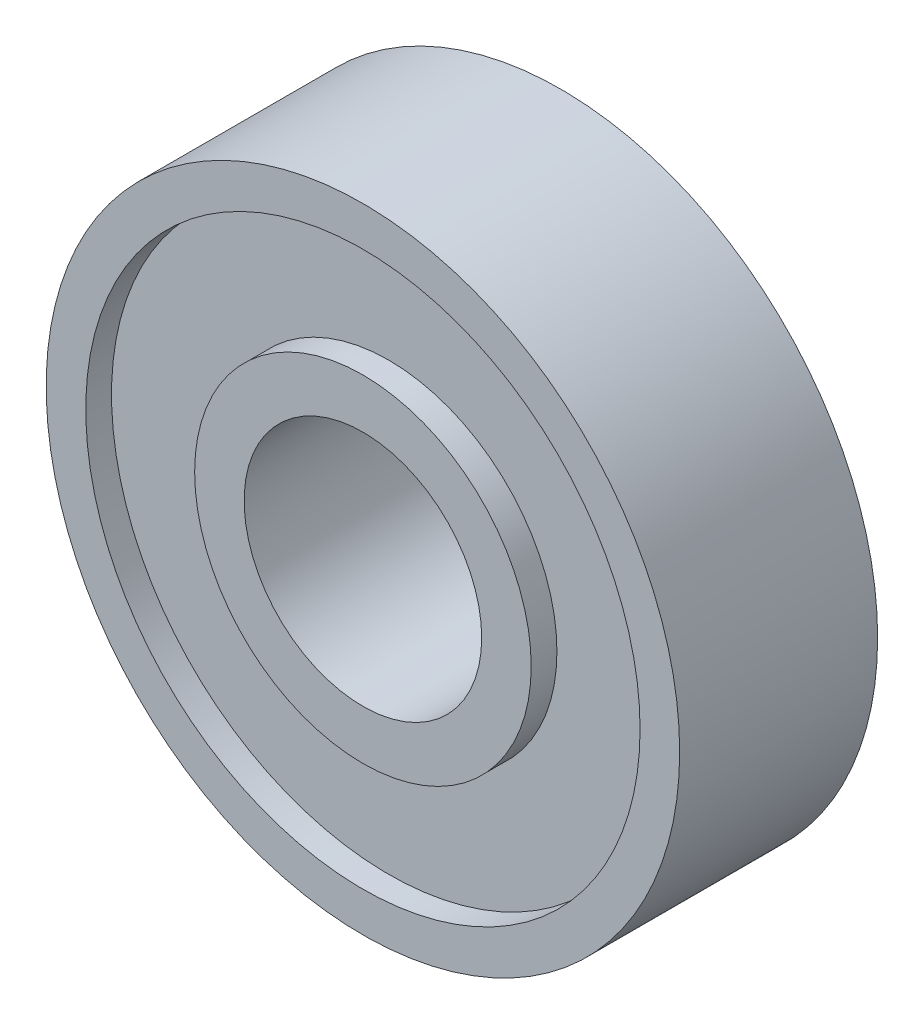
from build123d import *

# Parameters (mm, degrees)
CROQUIS1_R            = 16
CROQUIS1_R_2          = 6
EXTRUIR1_DEPTH        = 10
CROQUIS2_R            = 14
CROQUIS2_R_2          = 8.5
CORTAR_EXTRUIR1_DEPTH = 1.3
CROQUIS3_R            = 12.25
CROQUIS3_R_2          = 8
CORTAR_EXTRUIR2_DEPTH = 1.8


with BuildPart() as part:
    # Croquis1 → Extruir1 (new body)
    with BuildSketch(Plane.XY):
        Circle(CROQUIS1_R)
        Circle(CROQUIS1_R_2, mode=Mode.SUBTRACT)
    extrude(amount=EXTRUIR1_DEPTH)

    # Croquis2 → Cortar-Extruir1 (cut)
    with BuildSketch(Plane.XY.offset(10)):
        Circle(CROQUIS2_R)
        Circle(CROQUIS2_R_2, mode=Mode.SUBTRACT)
    extrude(amount=-CORTAR_EXTRUIR1_DEPTH, mode=Mode.SUBTRACT)

    # Croquis3 → Cortar-Extruir2 (cut)
    with BuildSketch(Plane(origin=(0, 0, 0), x_dir=(-1, 0, 0), z_dir=(0, 0, -1))):
        Circle(CROQUIS3_R)
        Circle(CROQUIS3_R_2, mode=Mode.SUBTRACT)
    extrude(amount=-CORTAR_EXTRUIR2_DEPTH, mode=Mode.SUBTRACT)


solid = part.part
